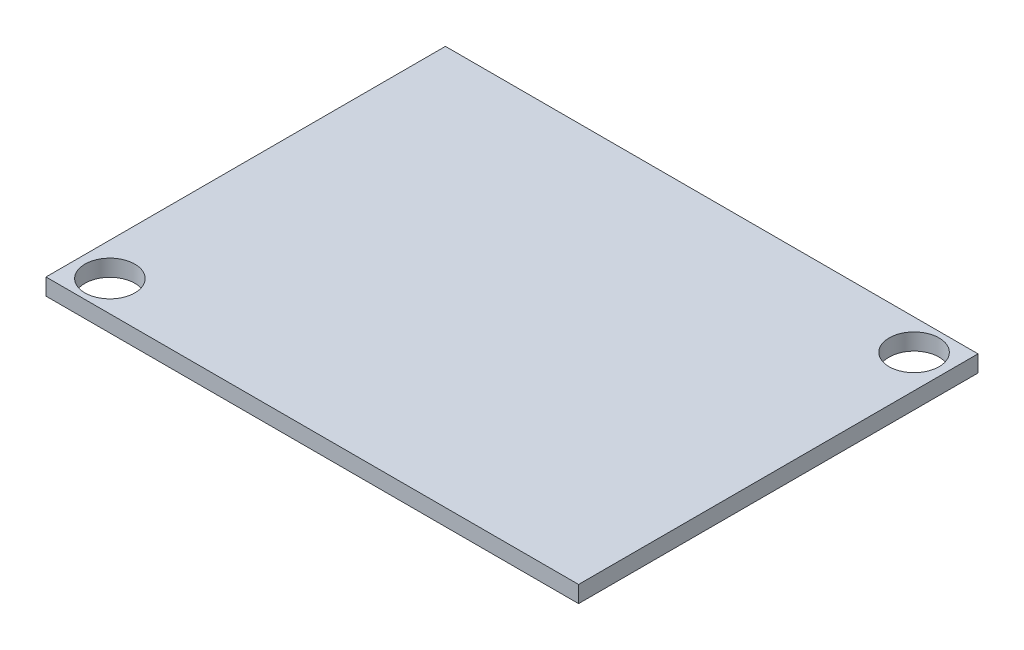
from build123d import *

# Parameters (mm, degrees)
SKETCH1_W          = 101.6
SKETCH1_H          = 76.2
EXTRUDE1_DEPTH     = 3.175
SKETCH2_R          = 4.7625
CUT_EXTRUDE1_DEPTH = 3.175


with BuildPart() as part:
    # Sketch1 → Extrude1 (new body)
    with BuildSketch(Plane(origin=(0, 0, 0), x_dir=(1, 0, 0), z_dir=(0, 1, 0))):
        with Locations((5.968072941, 13.195425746)):
            Rectangle(SKETCH1_W, SKETCH1_H)
    extrude(amount=EXTRUDE1_DEPTH)

    # Sketch2 → Cut-Extrude1 (cut)
    with BuildSketch(Plane(origin=(0, 3.175, 0), x_dir=(-1, 0, 0), z_dir=(0, 1, 0))):
        with Locations(Location((-50.418072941, -45.453425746, 0), (0, 0, 90))):
            Circle(SKETCH2_R)
        with Locations(Location((38.481927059, 19.062574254, 0), (0, 0, 90))):
            Circle(SKETCH2_R)
    extrude(amount=-CUT_EXTRUDE1_DEPTH, mode=Mode.SUBTRACT)


solid = part.part
